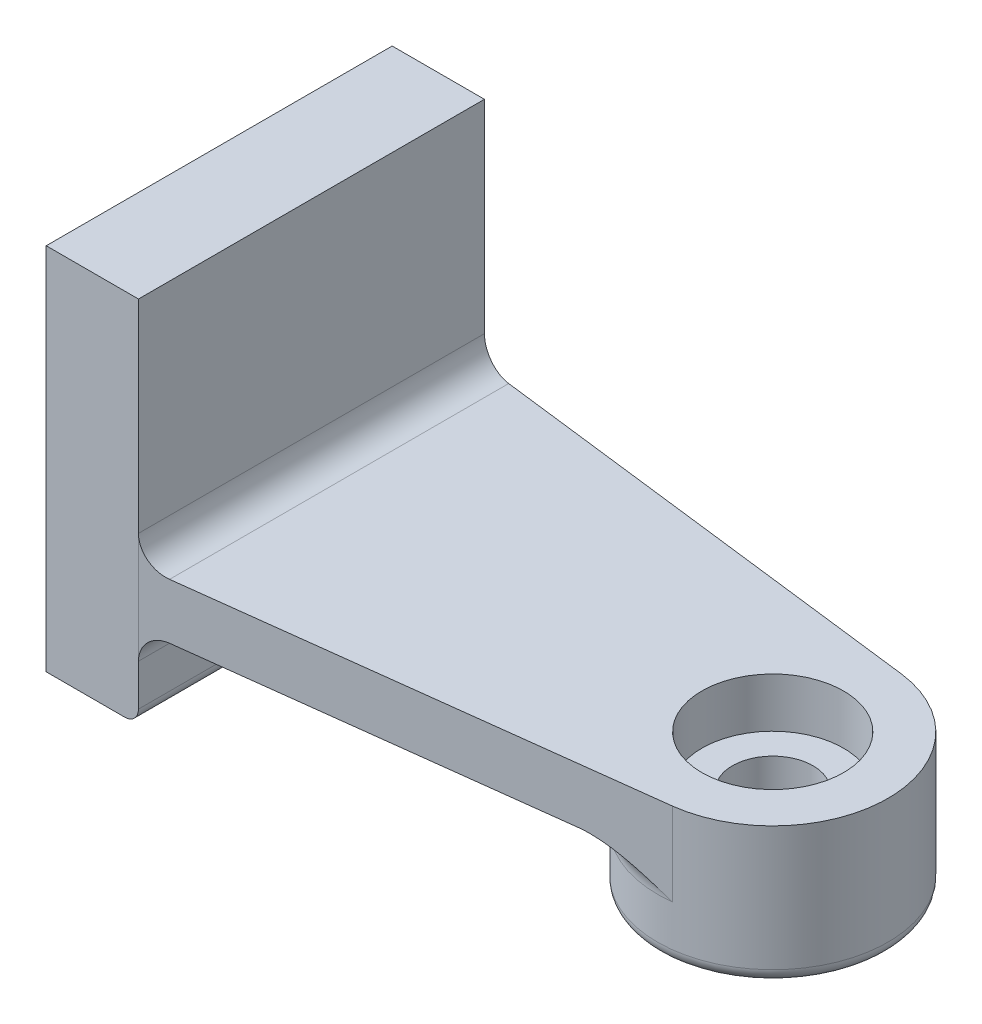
ISO-10303-21;
HEADER;
FILE_DESCRIPTION(('STEP AP214'),'2;1');
FILE_NAME('part.step','',(''),(''),'','','');
FILE_SCHEMA(('AUTOMOTIVE_DESIGN { 1 0 10303 214 1 1 1 1 }'));
ENDSEC;
DATA;
#1=APPLICATION_CONTEXT('core data for automotive mechanical design processes');
#2=APPLICATION_PROTOCOL_DEFINITION('international standard','automotive_design',2000,#1);
#3=PRODUCT_CONTEXT('',#1,'mechanical');
#4=PRODUCT('Part','Part','',(#3));
#5=PRODUCT_RELATED_PRODUCT_CATEGORY('part','',(#4));
#6=PRODUCT_DEFINITION_FORMATION('','',#4);
#7=PRODUCT_DEFINITION_CONTEXT('part definition',#1,'design');
#8=PRODUCT_DEFINITION('design','',#6,#7);
#9=PRODUCT_DEFINITION_SHAPE('','',#8);
#10=(LENGTH_UNIT() NAMED_UNIT(*) SI_UNIT(.MILLI.,.METRE.));
#11=(NAMED_UNIT(*) PLANE_ANGLE_UNIT() SI_UNIT($,.RADIAN.));
#12=(NAMED_UNIT(*) SI_UNIT($,.STERADIAN.) SOLID_ANGLE_UNIT());
#13=UNCERTAINTY_MEASURE_WITH_UNIT(LENGTH_MEASURE(1.E-05),#10,'distance_accuracy_value','');
#14=(GEOMETRIC_REPRESENTATION_CONTEXT(3) GLOBAL_UNCERTAINTY_ASSIGNED_CONTEXT((#13)) GLOBAL_UNIT_ASSIGNED_CONTEXT((#10,
#11,#12)) REPRESENTATION_CONTEXT('',''));
#15=CARTESIAN_POINT('',(0.,0.,0.));
#16=DIRECTION('',(0.,0.,1.));
#17=DIRECTION('',(1.,0.,0.));
#18=AXIS2_PLACEMENT_3D('',#15,#16,#17);
#19=CARTESIAN_POINT('',(100.,0.,0.));
#20=DIRECTION('',(0.,-1.,0.));
#21=DIRECTION('',(0.,0.,-1.));
#22=AXIS2_PLACEMENT_3D('',#19,#20,#21);
#23=PLANE('',#22);
#24=DIRECTION('',(-0.992506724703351,0.,-0.122190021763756));
#25=VECTOR('',#24,1.);
#26=CARTESIAN_POINT('',(0.,0.,-37.5));
#27=LINE('',#26,#25);
#28=CARTESIAN_POINT('',(84.8618017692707,0.,-27.0524482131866));
#29=VERTEX_POINT('',#28);
#30=CARTESIAN_POINT('',(6.,0.,-36.7613247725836));
#31=VERTEX_POINT('',#30);
#32=EDGE_CURVE('E242',#29,#31,#27,.T.);
#33=ORIENTED_EDGE('',*,*,#32,.F.);
#34=CARTESIAN_POINT('',(100.,0.,0.));
#35=DIRECTION('',(0.,-1.,0.));
#36=DIRECTION('',(0.,0.,-1.));
#37=AXIS2_PLACEMENT_3D('',#34,#35,#36);
#38=CIRCLE('',#37,31.);
#39=CARTESIAN_POINT('',(71.4167881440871,0.,-12.));
#40=VERTEX_POINT('',#39);
#41=EDGE_CURVE('E383',#29,#40,#38,.F.);
#42=ORIENTED_EDGE('',*,*,#41,.T.);
#43=DIRECTION('',(-1.,0.,0.));
#44=VECTOR('',#43,1.);
#45=CARTESIAN_POINT('',(100.,0.,-12.));
#46=LINE('',#45,#44);
#47=CARTESIAN_POINT('',(6.00000000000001,0.,-12.));
#48=VERTEX_POINT('',#47);
#49=EDGE_CURVE('E294',#40,#48,#46,.T.);
#50=ORIENTED_EDGE('',*,*,#49,.T.);
#51=DIRECTION('',(0.,0.,1.));
#52=VECTOR('',#51,1.);
#53=CARTESIAN_POINT('',(6.00000000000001,0.,0.));
#54=LINE('',#53,#52);
#55=EDGE_CURVE('E316',#48,#31,#54,.F.);
#56=ORIENTED_EDGE('',*,*,#55,.T.);
#57=EDGE_LOOP('',(#33,#42,#50,#56));
#58=FACE_BOUND('',#57,.T.);
#59=ADVANCED_FACE('F36',(#58),#23,.T.);
#60=CARTESIAN_POINT('',(0.,-18.,-37.5));
#61=DIRECTION('',(-1.,0.,0.));
#62=DIRECTION('',(0.,0.,1.));
#63=AXIS2_PLACEMENT_3D('',#60,#61,#62);
#64=PLANE('',#63);
#65=DIRECTION('',(0.,1.,0.));
#66=VECTOR('',#65,1.);
#67=CARTESIAN_POINT('',(0.,-18.,-12.));
#68=LINE('',#67,#66);
#69=CARTESIAN_POINT('',(0.,-6.,-12.));
#70=VERTEX_POINT('',#69);
#71=CARTESIAN_POINT('',(0.,-15.,-12.));
#72=VERTEX_POINT('',#71);
#73=EDGE_CURVE('E398',#70,#72,#68,.F.);
#74=ORIENTED_EDGE('',*,*,#73,.T.);
#75=DIRECTION('',(0.,0.,1.));
#76=VECTOR('',#75,1.);
#77=CARTESIAN_POINT('',(0.,-15.,-37.5));
#78=LINE('',#77,#76);
#79=CARTESIAN_POINT('',(0.,-15.,-37.5));
#80=VERTEX_POINT('',#79);
#81=EDGE_CURVE('E862',#72,#80,#78,.F.);
#82=ORIENTED_EDGE('',*,*,#81,.T.);
#83=DIRECTION('',(0.,-1.,0.));
#84=VECTOR('',#83,1.);
#85=CARTESIAN_POINT('',(0.,62.,-37.5));
#86=LINE('',#85,#84);
#87=CARTESIAN_POINT('',(0.,-6.00000000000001,-37.5));
#88=VERTEX_POINT('',#87);
#89=EDGE_CURVE('E253',#88,#80,#86,.T.);
#90=ORIENTED_EDGE('',*,*,#89,.F.);
#91=DIRECTION('',(0.,0.,1.));
#92=VECTOR('',#91,1.);
#93=CARTESIAN_POINT('',(0.,-6.,-37.5));
#94=LINE('',#93,#92);
#95=EDGE_CURVE('E269',#88,#70,#94,.T.);
#96=ORIENTED_EDGE('',*,*,#95,.T.);
#97=EDGE_LOOP('',(#74,#82,#90,#96));
#98=FACE_BOUND('',#97,.T.);
#99=ADVANCED_FACE('F471',(#98),#64,.F.);
#100=DIRECTION('',(0.,0.,1.));
#101=VECTOR('',#100,1.);
#102=CARTESIAN_POINT('',(6.00000000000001,0.,0.));
#103=LINE('',#102,#101);
#104=CARTESIAN_POINT('',(6.,0.,36.7613247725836));
#105=VERTEX_POINT('',#104);
#106=CARTESIAN_POINT('',(6.00000000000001,0.,12.));
#107=VERTEX_POINT('',#106);
#108=EDGE_CURVE('E310',#105,#107,#103,.F.);
#109=ORIENTED_EDGE('',*,*,#108,.T.);
#110=DIRECTION('',(-1.,0.,0.));
#111=VECTOR('',#110,1.);
#112=CARTESIAN_POINT('',(71.4167881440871,0.,12.));
#113=LINE('',#112,#111);
#114=CARTESIAN_POINT('',(71.4167881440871,0.,12.));
#115=VERTEX_POINT('',#114);
#116=EDGE_CURVE('E292',#107,#115,#113,.F.);
#117=ORIENTED_EDGE('',*,*,#116,.T.);
#118=CARTESIAN_POINT('',(100.,0.,0.));
#119=DIRECTION('',(0.,-1.,0.));
#120=DIRECTION('',(0.,0.,-1.));
#121=AXIS2_PLACEMENT_3D('',#118,#119,#120);
#122=CIRCLE('',#121,31.);
#123=CARTESIAN_POINT('',(84.8618017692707,0.,27.0524482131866));
#124=VERTEX_POINT('',#123);
#125=EDGE_CURVE('E290',#115,#124,#122,.F.);
#126=ORIENTED_EDGE('',*,*,#125,.T.);
#127=DIRECTION('',(0.992506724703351,0.,-0.122190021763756));
#128=VECTOR('',#127,1.);
#129=CARTESIAN_POINT('',(0.,0.,37.5));
#130=LINE('',#129,#128);
#131=EDGE_CURVE('E239',#105,#124,#130,.T.);
#132=ORIENTED_EDGE('',*,*,#131,.F.);
#133=EDGE_LOOP('',(#109,#117,#126,#132));
#134=FACE_BOUND('',#133,.T.);
#135=ADVANCED_FACE('F424',(#134),#23,.T.);
#136=CARTESIAN_POINT('',(0.,12.,37.5));
#137=DIRECTION('',(-0.122190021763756,0.,-0.992506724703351));
#138=DIRECTION('',(-0.992506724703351,0.,0.122190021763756));
#139=AXIS2_PLACEMENT_3D('',#136,#137,#138);
#140=PLANE('',#139);
#141=DIRECTION('',(0.,-1.,0.));
#142=VECTOR('',#141,1.);
#143=CARTESIAN_POINT('',(0.,12.,37.5));
#144=LINE('',#143,#142);
#145=CARTESIAN_POINT('',(0.,18.,37.5));
#146=VERTEX_POINT('',#145);
#147=CARTESIAN_POINT('',(0.,-6.,37.5));
#148=VERTEX_POINT('',#147);
#149=EDGE_CURVE('E339',#146,#148,#144,.T.);
#150=ORIENTED_EDGE('',*,*,#149,.T.);
#151=CARTESIAN_POINT('',(6.,-6.,36.7613247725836));
#152=DIRECTION('',(-0.122190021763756,0.,-0.992506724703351));
#153=DIRECTION('',(-0.992506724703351,0.,0.122190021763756));
#154=AXIS2_PLACEMENT_3D('',#151,#152,#153);
#155=ELLIPSE('',#154,6.04529909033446,6.);
#156=EDGE_CURVE('E277',#148,#105,#155,.T.);
#157=ORIENTED_EDGE('',*,*,#156,.T.);
#158=ORIENTED_EDGE('',*,*,#131,.T.);
#159=CARTESIAN_POINT('',(84.8618017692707,0.,27.0524482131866));
#160=CARTESIAN_POINT('',(85.1862334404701,-3.27743544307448E-05,27.0125066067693));
#161=CARTESIAN_POINT('',(85.5105668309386,-0.00933756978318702,26.9725770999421));
#162=CARTESIAN_POINT('',(86.1581547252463,-0.04477372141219,26.8928509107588));
#163=CARTESIAN_POINT('',(86.4814097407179,-0.0708954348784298,26.8530541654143));
#164=CARTESIAN_POINT('',(87.1253884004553,-0.138153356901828,26.7737723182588));
#165=CARTESIAN_POINT('',(87.4461166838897,-0.179245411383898,26.734286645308));
#166=CARTESIAN_POINT('',(88.0855999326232,-0.274982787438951,26.6555582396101));
#167=CARTESIAN_POINT('',(88.4043545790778,-0.329630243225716,26.6163155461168));
#168=CARTESIAN_POINT('',(89.3490391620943,-0.51029693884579,26.5000130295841));
#169=CARTESIAN_POINT('',(89.9716743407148,-0.65397965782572,26.4233588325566));
#170=CARTESIAN_POINT('',(91.2072563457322,-0.979869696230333,26.271243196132));
#171=CARTESIAN_POINT('',(91.8201943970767,-1.16210997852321,26.1957828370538));
#172=CARTESIAN_POINT('',(92.8856905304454,-1.50856862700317,26.0646069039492));
#173=CARTESIAN_POINT('',(93.3404203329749,-1.66609616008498,26.0086239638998));
#174=CARTESIAN_POINT('',(94.2446138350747,-1.99585169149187,25.8973064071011));
#175=CARTESIAN_POINT('',(94.694077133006,-2.16808080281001,25.8419718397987));
#176=CARTESIAN_POINT('',(96.0352444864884,-2.70291236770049,25.6768573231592));
#177=CARTESIAN_POINT('',(96.9197922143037,-3.08368139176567,25.5679584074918));
#178=CARTESIAN_POINT('',(98.6783128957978,-3.87713108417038,25.3514624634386));
#179=CARTESIAN_POINT('',(99.5522342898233,-4.28992516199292,25.2438717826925));
#180=CARTESIAN_POINT('',(101.292974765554,-5.1304855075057,25.0295648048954));
#181=CARTESIAN_POINT('',(102.15979321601,-5.55825308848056,24.922848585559));
#182=CARTESIAN_POINT('',(103.035960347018,-5.99072522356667,24.8149814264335));
#183=CARTESIAN_POINT('',(103.045355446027,-5.9953626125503,24.8138247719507));
#184=CARTESIAN_POINT('',(103.054750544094,-6.,24.8126681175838));
#185=B_SPLINE_CURVE_WITH_KNOTS('',3,(#159,#160,#161,#162,#163,#164,#165,#166,#167,#168,#169,
#170,#171,#172,#173,#174,#175,#176,#177,#178,#179,#180,#181,#182,#183,#184),.UNSPECIFIED.,.F.,
.F.,(4,2,2,2,2,2,2,2,2,2,2,2,4),(0.,0.98036870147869,1.96017576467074,2.93711604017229,
3.91421022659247,5.84327000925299,7.77398565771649,9.227172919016,10.6804702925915,
13.5868543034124,16.5040468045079,19.4214958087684,19.4531185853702),.UNSPECIFIED.);
#186=CARTESIAN_POINT('',(103.054750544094,-6.,24.8126681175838));
#187=VERTEX_POINT('',#186);
#188=EDGE_CURVE('E370',#124,#187,#185,.T.);
#189=ORIENTED_EDGE('',*,*,#188,.T.);
#190=DIRECTION('',(0.,-1.,0.));
#191=VECTOR('',#190,1.);
#192=CARTESIAN_POINT('',(103.054750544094,12.,24.8126681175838));
#193=LINE('',#192,#191);
#194=CARTESIAN_POINT('',(103.054750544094,12.,24.8126681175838));
#195=VERTEX_POINT('',#194);
#196=EDGE_CURVE('E344',#195,#187,#193,.T.);
#197=ORIENTED_EDGE('',*,*,#196,.F.);
#198=DIRECTION('',(0.992506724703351,0.,-0.122190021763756));
#199=VECTOR('',#198,1.);
#200=CARTESIAN_POINT('',(0.,12.,37.5));
#201=LINE('',#200,#199);
#202=CARTESIAN_POINT('',(6.00000000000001,12.,36.7613247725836));
#203=VERTEX_POINT('',#202);
#204=EDGE_CURVE('E297',#203,#195,#201,.T.);
#205=ORIENTED_EDGE('',*,*,#204,.F.);
#206=CARTESIAN_POINT('',(6.00000000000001,18.,36.7613247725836));
#207=DIRECTION('',(-0.122190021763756,0.,-0.992506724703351));
#208=DIRECTION('',(0.992506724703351,0.,-0.122190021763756));
#209=AXIS2_PLACEMENT_3D('',#206,#207,#208);
#210=ELLIPSE('',#209,6.04529909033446,6.);
#211=EDGE_CURVE('E272',#203,#146,#210,.T.);
#212=ORIENTED_EDGE('',*,*,#211,.T.);
#213=EDGE_LOOP('',(#150,#157,#158,#189,#197,#205,#212));
#214=FACE_BOUND('',#213,.T.);
#215=ADVANCED_FACE('F371',(#214),#140,.F.);
#216=CARTESIAN_POINT('',(100.,12.,0.));
#217=DIRECTION('',(0.,-1.,0.));
#218=DIRECTION('',(0.,0.,-1.));
#219=AXIS2_PLACEMENT_3D('',#216,#217,#218);
#220=CYLINDRICAL_SURFACE('',#219,25.);
#221=DIRECTION('',(0.,-1.,0.));
#222=VECTOR('',#221,1.);
#223=CARTESIAN_POINT('',(76.9490226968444,12.,9.67741935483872));
#224=LINE('',#223,#222);
#225=CARTESIAN_POINT('',(76.9490226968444,-6.,9.67741935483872));
#226=VERTEX_POINT('',#225);
#227=CARTESIAN_POINT('',(76.9490226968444,-15.,9.67741935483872));
#228=VERTEX_POINT('',#227);
#229=EDGE_CURVE('E326',#226,#228,#224,.T.);
#230=ORIENTED_EDGE('',*,*,#229,.T.);
#231=CARTESIAN_POINT('',(100.,-15.,0.));
#232=DIRECTION('',(0.,1.,0.));
#233=DIRECTION('',(0.,0.,1.));
#234=AXIS2_PLACEMENT_3D('',#231,#232,#233);
#235=CIRCLE('',#234,25.);
#236=CARTESIAN_POINT('',(76.9490226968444,-15.,-9.67741935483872));
#237=VERTEX_POINT('',#236);
#238=EDGE_CURVE('E60',#228,#237,#235,.T.);
#239=ORIENTED_EDGE('',*,*,#238,.T.);
#240=DIRECTION('',(0.,-1.,0.));
#241=VECTOR('',#240,1.);
#242=CARTESIAN_POINT('',(76.9490226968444,12.,-9.67741935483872));
#243=LINE('',#242,#241);
#244=CARTESIAN_POINT('',(76.9490226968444,-6.,-9.67741935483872));
#245=VERTEX_POINT('',#244);
#246=EDGE_CURVE('E321',#237,#245,#243,.F.);
#247=ORIENTED_EDGE('',*,*,#246,.T.);
#248=CARTESIAN_POINT('',(100.,-6.,0.));
#249=DIRECTION('',(0.,-1.,0.));
#250=DIRECTION('',(0.,0.,-1.));
#251=AXIS2_PLACEMENT_3D('',#248,#249,#250);
#252=CIRCLE('',#251,25.);
#253=CARTESIAN_POINT('',(103.054750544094,-6.,-24.8126681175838));
#254=VERTEX_POINT('',#253);
#255=EDGE_CURVE('E382',#245,#254,#252,.T.);
#256=ORIENTED_EDGE('',*,*,#255,.T.);
#257=DIRECTION('',(0.,-1.,0.));
#258=VECTOR('',#257,1.);
#259=CARTESIAN_POINT('',(103.054750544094,12.,-24.8126681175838));
#260=LINE('',#259,#258);
#261=CARTESIAN_POINT('',(103.054750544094,12.,-24.8126681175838));
#262=VERTEX_POINT('',#261);
#263=EDGE_CURVE('E354',#262,#254,#260,.T.);
#264=ORIENTED_EDGE('',*,*,#263,.F.);
#265=CARTESIAN_POINT('',(100.,12.,0.));
#266=DIRECTION('',(0.,1.,0.));
#267=DIRECTION('',(0.,0.,-1.));
#268=AXIS2_PLACEMENT_3D('',#265,#266,#267);
#269=CIRCLE('',#268,25.);
#270=EDGE_CURVE('E254',#195,#262,#269,.T.);
#271=ORIENTED_EDGE('',*,*,#270,.F.);
#272=ORIENTED_EDGE('',*,*,#196,.T.);
#273=CARTESIAN_POINT('',(100.,-6.,0.));
#274=DIRECTION('',(0.,-1.,0.));
#275=DIRECTION('',(0.,0.,-1.));
#276=AXIS2_PLACEMENT_3D('',#273,#274,#275);
#277=CIRCLE('',#276,25.);
#278=EDGE_CURVE('E365',#187,#226,#277,.T.);
#279=ORIENTED_EDGE('',*,*,#278,.T.);
#280=EDGE_LOOP('',(#230,#239,#247,#256,#264,#271,#272,#279));
#281=FACE_BOUND('',#280,.T.);
#282=ADVANCED_FACE('F363',(#281),#220,.T.);
#283=CARTESIAN_POINT('',(0.,12.,-37.5));
#284=DIRECTION('',(-0.122190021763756,0.,0.992506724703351));
#285=DIRECTION('',(0.992506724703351,0.,0.122190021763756));
#286=AXIS2_PLACEMENT_3D('',#283,#284,#285);
#287=PLANE('',#286);
#288=ORIENTED_EDGE('',*,*,#263,.T.);
#289=CARTESIAN_POINT('',(84.8618017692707,0.,-27.0524482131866));
#290=CARTESIAN_POINT('',(85.1862334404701,-3.27743544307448E-05,-27.0125066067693));
#291=CARTESIAN_POINT('',(85.5105668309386,-0.00933756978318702,-26.9725770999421));
#292=CARTESIAN_POINT('',(86.1581547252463,-0.04477372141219,-26.8928509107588));
#293=CARTESIAN_POINT('',(86.4814097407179,-0.0708954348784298,-26.8530541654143));
#294=CARTESIAN_POINT('',(87.1253884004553,-0.138153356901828,-26.7737723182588));
#295=CARTESIAN_POINT('',(87.4461166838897,-0.179245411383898,-26.734286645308));
#296=CARTESIAN_POINT('',(88.0855999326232,-0.274982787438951,-26.6555582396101));
#297=CARTESIAN_POINT('',(88.4043545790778,-0.329630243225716,-26.6163155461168));
#298=CARTESIAN_POINT('',(89.3490391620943,-0.51029693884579,-26.5000130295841));
#299=CARTESIAN_POINT('',(89.9716743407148,-0.65397965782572,-26.4233588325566));
#300=CARTESIAN_POINT('',(91.2072563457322,-0.979869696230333,-26.271243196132));
#301=CARTESIAN_POINT('',(91.8201943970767,-1.16210997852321,-26.1957828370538));
#302=CARTESIAN_POINT('',(92.8856905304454,-1.50856862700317,-26.0646069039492));
#303=CARTESIAN_POINT('',(93.3404203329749,-1.66609616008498,-26.0086239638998));
#304=CARTESIAN_POINT('',(94.2446138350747,-1.99585169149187,-25.8973064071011));
#305=CARTESIAN_POINT('',(94.694077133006,-2.16808080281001,-25.8419718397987));
#306=CARTESIAN_POINT('',(96.0352444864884,-2.70291236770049,-25.6768573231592));
#307=CARTESIAN_POINT('',(96.9197922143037,-3.08368139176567,-25.5679584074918));
#308=CARTESIAN_POINT('',(98.6783128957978,-3.87713108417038,-25.3514624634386));
#309=CARTESIAN_POINT('',(99.5522342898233,-4.28992516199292,-25.2438717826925));
#310=CARTESIAN_POINT('',(101.292974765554,-5.1304855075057,-25.0295648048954));
#311=CARTESIAN_POINT('',(102.15979321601,-5.55825308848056,-24.922848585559));
#312=CARTESIAN_POINT('',(103.035960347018,-5.99072522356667,-24.8149814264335));
#313=CARTESIAN_POINT('',(103.045355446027,-5.9953626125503,-24.8138247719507));
#314=CARTESIAN_POINT('',(103.054750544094,-6.,-24.8126681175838));
#315=B_SPLINE_CURVE_WITH_KNOTS('',3,(#289,#290,#291,#292,#293,#294,#295,#296,#297,#298,#299,
#300,#301,#302,#303,#304,#305,#306,#307,#308,#309,#310,#311,#312,#313,#314),.UNSPECIFIED.,.F.,
.F.,(4,2,2,2,2,2,2,2,2,2,2,2,4),(0.,0.98036870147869,1.96017576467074,2.93711604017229,
3.91421022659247,5.84327000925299,7.77398565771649,9.227172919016,10.6804702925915,
13.5868543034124,16.5040468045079,19.4214958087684,19.4531185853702),.UNSPECIFIED.);
#316=EDGE_CURVE('E375',#254,#29,#315,.F.);
#317=ORIENTED_EDGE('',*,*,#316,.T.);
#318=ORIENTED_EDGE('',*,*,#32,.T.);
#319=CARTESIAN_POINT('',(6.,-6.,-36.7613247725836));
#320=DIRECTION('',(-0.122190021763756,0.,0.992506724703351));
#321=DIRECTION('',(0.992506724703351,0.,0.122190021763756));
#322=AXIS2_PLACEMENT_3D('',#319,#320,#321);
#323=ELLIPSE('',#322,6.04529909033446,6.);
#324=EDGE_CURVE('E279',#31,#88,#323,.T.);
#325=ORIENTED_EDGE('',*,*,#324,.T.);
#326=DIRECTION('',(0.,-1.,0.));
#327=VECTOR('',#326,1.);
#328=CARTESIAN_POINT('',(0.,12.,-37.5));
#329=LINE('',#328,#327);
#330=CARTESIAN_POINT('',(0.,18.,-37.5));
#331=VERTEX_POINT('',#330);
#332=EDGE_CURVE('E352',#331,#88,#329,.T.);
#333=ORIENTED_EDGE('',*,*,#332,.F.);
#334=CARTESIAN_POINT('',(6.00000000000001,18.,-36.7613247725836));
#335=DIRECTION('',(-0.122190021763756,0.,0.992506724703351));
#336=DIRECTION('',(-0.992506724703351,0.,-0.122190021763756));
#337=AXIS2_PLACEMENT_3D('',#334,#335,#336);
#338=ELLIPSE('',#337,6.04529909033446,6.);
#339=CARTESIAN_POINT('',(6.00000000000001,12.,-36.7613247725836));
#340=VERTEX_POINT('',#339);
#341=EDGE_CURVE('E275',#331,#340,#338,.T.);
#342=ORIENTED_EDGE('',*,*,#341,.T.);
#343=DIRECTION('',(-0.992506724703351,0.,-0.122190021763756));
#344=VECTOR('',#343,1.);
#345=CARTESIAN_POINT('',(0.,12.,-37.5));
#346=LINE('',#345,#344);
#347=EDGE_CURVE('E349',#262,#340,#346,.T.);
#348=ORIENTED_EDGE('',*,*,#347,.F.);
#349=EDGE_LOOP('',(#288,#317,#318,#325,#333,#342,#348));
#350=FACE_BOUND('',#349,.T.);
#351=ADVANCED_FACE('F418',(#350),#287,.F.);
#352=CARTESIAN_POINT('',(100.,12.,0.));
#353=DIRECTION('',(0.,-1.,0.));
#354=DIRECTION('',(0.,0.,-1.));
#355=AXIS2_PLACEMENT_3D('',#352,#353,#354);
#356=PLANE('',#355);
#357=CARTESIAN_POINT('',(100.,12.,0.));
#358=DIRECTION('',(0.,1.,0.));
#359=DIRECTION('',(0.,0.,1.));
#360=AXIS2_PLACEMENT_3D('',#357,#358,#359);
#361=CIRCLE('',#360,15.355);
#362=CARTESIAN_POINT('',(100.,12.,15.355));
#363=VERTEX_POINT('',#362);
#364=EDGE_CURVE('E956',#363,#363,#361,.T.);
#365=ORIENTED_EDGE('',*,*,#364,.F.);
#366=EDGE_LOOP('',(#365));
#367=FACE_BOUND('',#366,.T.);
#368=ORIENTED_EDGE('',*,*,#347,.T.);
#369=DIRECTION('',(0.,0.,1.));
#370=VECTOR('',#369,1.);
#371=CARTESIAN_POINT('',(6.00000000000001,12.,37.5));
#372=LINE('',#371,#370);
#373=EDGE_CURVE('E335',#340,#203,#372,.T.);
#374=ORIENTED_EDGE('',*,*,#373,.T.);
#375=ORIENTED_EDGE('',*,*,#204,.T.);
#376=ORIENTED_EDGE('',*,*,#270,.T.);
#377=EDGE_LOOP('',(#368,#374,#375,#376));
#378=FACE_BOUND('',#377,.T.);
#379=ADVANCED_FACE('F423',(#367,#378),#356,.F.);
#380=DIRECTION('',(0.,1.,0.));
#381=VECTOR('',#380,1.);
#382=CARTESIAN_POINT('',(0.,62.,37.5));
#383=LINE('',#382,#381);
#384=CARTESIAN_POINT('',(0.,-15.,37.5));
#385=VERTEX_POINT('',#384);
#386=EDGE_CURVE('E337',#385,#148,#383,.T.);
#387=ORIENTED_EDGE('',*,*,#386,.F.);
#388=DIRECTION('',(0.,0.,1.));
#389=VECTOR('',#388,1.);
#390=CARTESIAN_POINT('',(0.,-15.,-37.5));
#391=LINE('',#390,#389);
#392=CARTESIAN_POINT('',(0.,-15.,12.));
#393=VERTEX_POINT('',#392);
#394=EDGE_CURVE('E860',#385,#393,#391,.F.);
#395=ORIENTED_EDGE('',*,*,#394,.T.);
#396=DIRECTION('',(0.,1.,0.));
#397=VECTOR('',#396,1.);
#398=CARTESIAN_POINT('',(0.,-18.,12.));
#399=LINE('',#398,#397);
#400=CARTESIAN_POINT('',(0.,-6.,12.));
#401=VERTEX_POINT('',#400);
#402=EDGE_CURVE('E390',#393,#401,#399,.T.);
#403=ORIENTED_EDGE('',*,*,#402,.T.);
#404=DIRECTION('',(0.,0.,1.));
#405=VECTOR('',#404,1.);
#406=CARTESIAN_POINT('',(0.,-6.,-37.5));
#407=LINE('',#406,#405);
#408=EDGE_CURVE('E267',#401,#148,#407,.T.);
#409=ORIENTED_EDGE('',*,*,#408,.T.);
#410=EDGE_LOOP('',(#387,#395,#403,#409));
#411=FACE_BOUND('',#410,.T.);
#412=ADVANCED_FACE('F477',(#411),#64,.F.);
#413=CARTESIAN_POINT('',(-20.,62.,-37.5));
#414=DIRECTION('',(0.,0.,1.));
#415=DIRECTION('',(0.,-1.,0.));
#416=AXIS2_PLACEMENT_3D('',#413,#414,#415);
#417=PLANE('',#416);
#418=ORIENTED_EDGE('',*,*,#89,.T.);
#419=CARTESIAN_POINT('',(-3.,-15.,-37.5));
#420=DIRECTION('',(0.,0.,1.));
#421=DIRECTION('',(0.,-1.,0.));
#422=AXIS2_PLACEMENT_3D('',#419,#420,#421);
#423=CIRCLE('',#422,3.);
#424=CARTESIAN_POINT('',(-3.,-18.,-37.5));
#425=VERTEX_POINT('',#424);
#426=EDGE_CURVE('E238',#80,#425,#423,.F.);
#427=ORIENTED_EDGE('',*,*,#426,.T.);
#428=DIRECTION('',(1.,0.,0.));
#429=VECTOR('',#428,1.);
#430=CARTESIAN_POINT('',(-20.,-18.,-37.5));
#431=LINE('',#430,#429);
#432=CARTESIAN_POINT('',(-20.,-18.,-37.5));
#433=VERTEX_POINT('',#432);
#434=EDGE_CURVE('E217',#433,#425,#431,.T.);
#435=ORIENTED_EDGE('',*,*,#434,.F.);
#436=DIRECTION('',(0.,-1.,0.));
#437=VECTOR('',#436,1.);
#438=CARTESIAN_POINT('',(-20.,62.,-37.5));
#439=LINE('',#438,#437);
#440=CARTESIAN_POINT('',(-20.,62.,-37.5));
#441=VERTEX_POINT('',#440);
#442=EDGE_CURVE('E224',#441,#433,#439,.T.);
#443=ORIENTED_EDGE('',*,*,#442,.F.);
#444=DIRECTION('',(1.,0.,0.));
#445=VECTOR('',#444,1.);
#446=CARTESIAN_POINT('',(-20.,62.,-37.5));
#447=LINE('',#446,#445);
#448=CARTESIAN_POINT('',(0.,62.,-37.5));
#449=VERTEX_POINT('',#448);
#450=EDGE_CURVE('E961',#441,#449,#447,.T.);
#451=ORIENTED_EDGE('',*,*,#450,.T.);
#452=EDGE_CURVE('E248',#449,#331,#86,.T.);
#453=ORIENTED_EDGE('',*,*,#452,.T.);
#454=ORIENTED_EDGE('',*,*,#332,.T.);
#455=EDGE_LOOP('',(#418,#427,#435,#443,#451,#453,#454));
#456=FACE_BOUND('',#455,.T.);
#457=ADVANCED_FACE('F236',(#456),#417,.F.);
#458=CARTESIAN_POINT('',(-20.,-18.,-37.5));
#459=DIRECTION('',(0.,1.,0.));
#460=DIRECTION('',(0.,0.,1.));
#461=AXIS2_PLACEMENT_3D('',#458,#459,#460);
#462=PLANE('',#461);
#463=ORIENTED_EDGE('',*,*,#434,.T.);
#464=DIRECTION('',(0.,0.,1.));
#465=VECTOR('',#464,1.);
#466=CARTESIAN_POINT('',(-3.,-18.,-37.5));
#467=LINE('',#466,#465);
#468=CARTESIAN_POINT('',(-3.,-18.,-12.));
#469=VERTEX_POINT('',#468);
#470=EDGE_CURVE('E926',#425,#469,#467,.T.);
#471=ORIENTED_EDGE('',*,*,#470,.T.);
#472=CARTESIAN_POINT('',(6.,-18.,-12.));
#473=DIRECTION('',(0.,1.,0.));
#474=DIRECTION('',(0.,0.,1.));
#475=AXIS2_PLACEMENT_3D('',#472,#473,#474);
#476=CIRCLE('',#475,9.);
#477=CARTESIAN_POINT('',(6.,-18.,-3.));
#478=VERTEX_POINT('',#477);
#479=EDGE_CURVE('E924',#469,#478,#476,.T.);
#480=ORIENTED_EDGE('',*,*,#479,.T.);
#481=DIRECTION('',(1.,0.,0.));
#482=VECTOR('',#481,1.);
#483=CARTESIAN_POINT('',(-20.,-18.,-3.));
#484=LINE('',#483,#482);
#485=CARTESIAN_POINT('',(71.4167881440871,-18.,-3.));
#486=VERTEX_POINT('',#485);
#487=EDGE_CURVE('E374',#478,#486,#484,.T.);
#488=ORIENTED_EDGE('',*,*,#487,.T.);
#489=CARTESIAN_POINT('',(71.4167881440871,-18.,-12.));
#490=DIRECTION('',(0.,1.,0.));
#491=DIRECTION('',(0.,0.,1.));
#492=AXIS2_PLACEMENT_3D('',#489,#490,#491);
#493=CIRCLE('',#492,9.);
#494=CARTESIAN_POINT('',(79.7151399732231,-18.,-8.51612903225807));
#495=VERTEX_POINT('',#494);
#496=EDGE_CURVE('E912',#486,#495,#493,.T.);
#497=ORIENTED_EDGE('',*,*,#496,.T.);
#498=CARTESIAN_POINT('',(100.,-18.,0.));
#499=DIRECTION('',(0.,1.,0.));
#500=DIRECTION('',(0.,0.,1.));
#501=AXIS2_PLACEMENT_3D('',#498,#499,#500);
#502=CIRCLE('',#501,22.);
#503=CARTESIAN_POINT('',(79.7151399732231,-18.,8.51612903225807));
#504=VERTEX_POINT('',#503);
#505=EDGE_CURVE('E914',#495,#504,#502,.F.);
#506=ORIENTED_EDGE('',*,*,#505,.T.);
#507=CARTESIAN_POINT('',(71.4167881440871,-18.,12.));
#508=DIRECTION('',(0.,1.,0.));
#509=DIRECTION('',(0.,0.,1.));
#510=AXIS2_PLACEMENT_3D('',#507,#508,#509);
#511=CIRCLE('',#510,9.);
#512=CARTESIAN_POINT('',(71.4167881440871,-18.,3.));
#513=VERTEX_POINT('',#512);
#514=EDGE_CURVE('E916',#504,#513,#511,.T.);
#515=ORIENTED_EDGE('',*,*,#514,.T.);
#516=DIRECTION('',(1.,0.,0.));
#517=VECTOR('',#516,1.);
#518=CARTESIAN_POINT('',(6.,-18.,3.));
#519=LINE('',#518,#517);
#520=CARTESIAN_POINT('',(6.,-18.,3.));
#521=VERTEX_POINT('',#520);
#522=EDGE_CURVE('E918',#513,#521,#519,.F.);
#523=ORIENTED_EDGE('',*,*,#522,.T.);
#524=CARTESIAN_POINT('',(6.,-18.,12.));
#525=DIRECTION('',(0.,1.,0.));
#526=DIRECTION('',(0.,0.,1.));
#527=AXIS2_PLACEMENT_3D('',#524,#525,#526);
#528=CIRCLE('',#527,9.);
#529=CARTESIAN_POINT('',(-3.,-18.,12.));
#530=VERTEX_POINT('',#529);
#531=EDGE_CURVE('E920',#521,#530,#528,.T.);
#532=ORIENTED_EDGE('',*,*,#531,.T.);
#533=DIRECTION('',(0.,0.,1.));
#534=VECTOR('',#533,1.);
#535=CARTESIAN_POINT('',(-3.,-18.,-37.5));
#536=LINE('',#535,#534);
#537=CARTESIAN_POINT('',(-3.,-18.,37.5));
#538=VERTEX_POINT('',#537);
#539=EDGE_CURVE('E922',#530,#538,#536,.T.);
#540=ORIENTED_EDGE('',*,*,#539,.T.);
#541=DIRECTION('',(1.,0.,0.));
#542=VECTOR('',#541,1.);
#543=CARTESIAN_POINT('',(-20.,-18.,37.5));
#544=LINE('',#543,#542);
#545=CARTESIAN_POINT('',(-20.,-18.,37.5));
#546=VERTEX_POINT('',#545);
#547=EDGE_CURVE('E220',#546,#538,#544,.T.);
#548=ORIENTED_EDGE('',*,*,#547,.F.);
#549=DIRECTION('',(0.,0.,1.));
#550=VECTOR('',#549,1.);
#551=CARTESIAN_POINT('',(-20.,-18.,-37.5));
#552=LINE('',#551,#550);
#553=EDGE_CURVE('E211',#433,#546,#552,.T.);
#554=ORIENTED_EDGE('',*,*,#553,.F.);
#555=EDGE_LOOP('',(#463,#471,#480,#488,#497,#506,#515,#523,#532,#540,#548,#554));
#556=FACE_BOUND('',#555,.T.);
#557=CARTESIAN_POINT('',(100.,-18.,0.));
#558=DIRECTION('',(0.,1.,0.));
#559=DIRECTION('',(0.,0.,1.));
#560=AXIS2_PLACEMENT_3D('',#557,#558,#559);
#561=CIRCLE('',#560,8.75);
#562=CARTESIAN_POINT('',(100.,-18.,8.75));
#563=VERTEX_POINT('',#562);
#564=EDGE_CURVE('E266',#563,#563,#561,.T.);
#565=ORIENTED_EDGE('',*,*,#564,.T.);
#566=EDGE_LOOP('',(#565));
#567=FACE_BOUND('',#566,.T.);
#568=ADVANCED_FACE('F213',(#556,#567),#462,.F.);
#569=CARTESIAN_POINT('',(-20.,62.,37.5));
#570=DIRECTION('',(0.,0.,-1.));
#571=DIRECTION('',(0.,1.,0.));
#572=AXIS2_PLACEMENT_3D('',#569,#570,#571);
#573=PLANE('',#572);
#574=ORIENTED_EDGE('',*,*,#547,.T.);
#575=CARTESIAN_POINT('',(-3.,-15.,37.5));
#576=DIRECTION('',(0.,0.,-1.));
#577=DIRECTION('',(0.,1.,0.));
#578=AXIS2_PLACEMENT_3D('',#575,#576,#577);
#579=CIRCLE('',#578,3.);
#580=EDGE_CURVE('E858',#538,#385,#579,.F.);
#581=ORIENTED_EDGE('',*,*,#580,.T.);
#582=ORIENTED_EDGE('',*,*,#386,.T.);
#583=ORIENTED_EDGE('',*,*,#149,.F.);
#584=CARTESIAN_POINT('',(0.,62.,37.5));
#585=VERTEX_POINT('',#584);
#586=EDGE_CURVE('E252',#146,#585,#383,.T.);
#587=ORIENTED_EDGE('',*,*,#586,.T.);
#588=DIRECTION('',(1.,0.,0.));
#589=VECTOR('',#588,1.);
#590=CARTESIAN_POINT('',(-20.,62.,37.5));
#591=LINE('',#590,#589);
#592=CARTESIAN_POINT('',(-20.,62.,37.5));
#593=VERTEX_POINT('',#592);
#594=EDGE_CURVE('E244',#593,#585,#591,.T.);
#595=ORIENTED_EDGE('',*,*,#594,.F.);
#596=DIRECTION('',(0.,1.,0.));
#597=VECTOR('',#596,1.);
#598=CARTESIAN_POINT('',(-20.,62.,37.5));
#599=LINE('',#598,#597);
#600=EDGE_CURVE('E223',#546,#593,#599,.T.);
#601=ORIENTED_EDGE('',*,*,#600,.F.);
#602=EDGE_LOOP('',(#574,#581,#582,#583,#587,#595,#601));
#603=FACE_BOUND('',#602,.T.);
#604=ADVANCED_FACE('F523',(#603),#573,.F.);
#605=CARTESIAN_POINT('',(-20.,62.,-37.5));
#606=DIRECTION('',(0.,-1.,0.));
#607=DIRECTION('',(0.,0.,-1.));
#608=AXIS2_PLACEMENT_3D('',#605,#606,#607);
#609=PLANE('',#608);
#610=DIRECTION('',(0.,0.,-1.));
#611=VECTOR('',#610,1.);
#612=CARTESIAN_POINT('',(0.,62.,-37.5));
#613=LINE('',#612,#611);
#614=EDGE_CURVE('E233',#585,#449,#613,.T.);
#615=ORIENTED_EDGE('',*,*,#614,.T.);
#616=ORIENTED_EDGE('',*,*,#450,.F.);
#617=DIRECTION('',(0.,0.,-1.));
#618=VECTOR('',#617,1.);
#619=CARTESIAN_POINT('',(-20.,62.,-37.5));
#620=LINE('',#619,#618);
#621=EDGE_CURVE('E229',#593,#441,#620,.T.);
#622=ORIENTED_EDGE('',*,*,#621,.F.);
#623=ORIENTED_EDGE('',*,*,#594,.T.);
#624=EDGE_LOOP('',(#615,#616,#622,#623));
#625=FACE_BOUND('',#624,.T.);
#626=ADVANCED_FACE('F530',(#625),#609,.F.);
#627=CARTESIAN_POINT('',(-20.,-18.,-37.5));
#628=DIRECTION('',(-1.,0.,0.));
#629=DIRECTION('',(0.,0.,1.));
#630=AXIS2_PLACEMENT_3D('',#627,#628,#629);
#631=PLANE('',#630);
#632=ORIENTED_EDGE('',*,*,#621,.T.);
#633=ORIENTED_EDGE('',*,*,#442,.T.);
#634=ORIENTED_EDGE('',*,*,#553,.T.);
#635=ORIENTED_EDGE('',*,*,#600,.T.);
#636=EDGE_LOOP('',(#632,#633,#634,#635));
#637=FACE_BOUND('',#636,.T.);
#638=ADVANCED_FACE('F227',(#637),#631,.T.);
#639=ORIENTED_EDGE('',*,*,#586,.F.);
#640=DIRECTION('',(0.,0.,1.));
#641=VECTOR('',#640,1.);
#642=CARTESIAN_POINT('',(0.,18.,-37.5));
#643=LINE('',#642,#641);
#644=EDGE_CURVE('E332',#146,#331,#643,.F.);
#645=ORIENTED_EDGE('',*,*,#644,.T.);
#646=ORIENTED_EDGE('',*,*,#452,.F.);
#647=ORIENTED_EDGE('',*,*,#614,.F.);
#648=EDGE_LOOP('',(#639,#645,#646,#647));
#649=FACE_BOUND('',#648,.T.);
#650=ADVANCED_FACE('F478',(#649),#64,.F.);
#651=CARTESIAN_POINT('',(52.5,22.,6.));
#652=DIRECTION('',(0.,0.,1.));
#653=DIRECTION('',(1.,0.,0.));
#654=AXIS2_PLACEMENT_3D('',#651,#652,#653);
#655=PLANE('',#654);
#656=DIRECTION('',(0.,1.,0.));
#657=VECTOR('',#656,1.);
#658=CARTESIAN_POINT('',(6.,22.,6.));
#659=LINE('',#658,#657);
#660=CARTESIAN_POINT('',(6.,-6.,6.));
#661=VERTEX_POINT('',#660);
#662=CARTESIAN_POINT('',(6.,-15.,6.));
#663=VERTEX_POINT('',#662);
#664=EDGE_CURVE('E285',#661,#663,#659,.F.);
#665=ORIENTED_EDGE('',*,*,#664,.T.);
#666=DIRECTION('',(1.,0.,0.));
#667=VECTOR('',#666,1.);
#668=CARTESIAN_POINT('',(71.4167881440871,-15.,6.));
#669=LINE('',#668,#667);
#670=CARTESIAN_POINT('',(71.4167881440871,-15.,6.));
#671=VERTEX_POINT('',#670);
#672=EDGE_CURVE('E870',#663,#671,#669,.T.);
#673=ORIENTED_EDGE('',*,*,#672,.T.);
#674=DIRECTION('',(0.,-1.,0.));
#675=VECTOR('',#674,1.);
#676=CARTESIAN_POINT('',(71.4167881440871,22.,6.));
#677=LINE('',#676,#675);
#678=CARTESIAN_POINT('',(71.4167881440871,-6.,6.));
#679=VERTEX_POINT('',#678);
#680=EDGE_CURVE('E308',#671,#679,#677,.F.);
#681=ORIENTED_EDGE('',*,*,#680,.T.);
#682=DIRECTION('',(-1.,0.,0.));
#683=VECTOR('',#682,1.);
#684=CARTESIAN_POINT('',(6.00000000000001,-6.,6.));
#685=LINE('',#684,#683);
#686=EDGE_CURVE('E288',#679,#661,#685,.T.);
#687=ORIENTED_EDGE('',*,*,#686,.T.);
#688=EDGE_LOOP('',(#665,#673,#681,#687));
#689=FACE_BOUND('',#688,.T.);
#690=ADVANCED_FACE('F552',(#689),#655,.T.);
#691=CARTESIAN_POINT('',(52.5,22.,-6.));
#692=DIRECTION('',(0.,0.,1.));
#693=DIRECTION('',(1.,0.,0.));
#694=AXIS2_PLACEMENT_3D('',#691,#692,#693);
#695=PLANE('',#694);
#696=DIRECTION('',(0.,1.,0.));
#697=VECTOR('',#696,1.);
#698=CARTESIAN_POINT('',(71.4167881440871,-18.,-6.));
#699=LINE('',#698,#697);
#700=CARTESIAN_POINT('',(71.4167881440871,-6.,-6.));
#701=VERTEX_POINT('',#700);
#702=CARTESIAN_POINT('',(71.4167881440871,-15.,-6.));
#703=VERTEX_POINT('',#702);
#704=EDGE_CURVE('E330',#701,#703,#699,.F.);
#705=ORIENTED_EDGE('',*,*,#704,.T.);
#706=DIRECTION('',(1.,0.,0.));
#707=VECTOR('',#706,1.);
#708=CARTESIAN_POINT('',(52.5,-15.,-6.));
#709=LINE('',#708,#707);
#710=CARTESIAN_POINT('',(6.,-15.,-6.));
#711=VERTEX_POINT('',#710);
#712=EDGE_CURVE('E11',#703,#711,#709,.F.);
#713=ORIENTED_EDGE('',*,*,#712,.T.);
#714=DIRECTION('',(0.,1.,0.));
#715=VECTOR('',#714,1.);
#716=CARTESIAN_POINT('',(6.,-6.,-6.));
#717=LINE('',#716,#715);
#718=CARTESIAN_POINT('',(6.,-6.,-6.));
#719=VERTEX_POINT('',#718);
#720=EDGE_CURVE('E396',#711,#719,#717,.T.);
#721=ORIENTED_EDGE('',*,*,#720,.T.);
#722=DIRECTION('',(-1.,0.,0.));
#723=VECTOR('',#722,1.);
#724=CARTESIAN_POINT('',(52.5,-6.,-6.));
#725=LINE('',#724,#723);
#726=EDGE_CURVE('E394',#719,#701,#725,.F.);
#727=ORIENTED_EDGE('',*,*,#726,.T.);
#728=EDGE_LOOP('',(#705,#713,#721,#727));
#729=FACE_BOUND('',#728,.T.);
#730=ADVANCED_FACE('F559',(#729),#695,.F.);
#731=CARTESIAN_POINT('',(100.,12.,0.));
#732=DIRECTION('',(0.,1.,0.));
#733=DIRECTION('',(0.,0.,1.));
#734=AXIS2_PLACEMENT_3D('',#731,#732,#733);
#735=CYLINDRICAL_SURFACE('',#734,8.75);
#736=CARTESIAN_POINT('',(100.,1.25,0.));
#737=DIRECTION('',(0.,1.,0.));
#738=DIRECTION('',(0.,0.,1.));
#739=AXIS2_PLACEMENT_3D('',#736,#737,#738);
#740=CIRCLE('',#739,8.75000000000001);
#741=CARTESIAN_POINT('',(100.,1.25,8.75000000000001));
#742=VERTEX_POINT('',#741);
#743=EDGE_CURVE('E950',#742,#742,#740,.T.);
#744=ORIENTED_EDGE('',*,*,#743,.T.);
#745=EDGE_LOOP('',(#744));
#746=FACE_BOUND('',#745,.T.);
#747=ORIENTED_EDGE('',*,*,#564,.F.);
#748=EDGE_LOOP('',(#747));
#749=FACE_BOUND('',#748,.T.);
#750=ADVANCED_FACE('F566',(#746,#749),#735,.F.);
#751=CARTESIAN_POINT('',(100.,12.,0.));
#752=DIRECTION('',(0.,1.,0.));
#753=DIRECTION('',(0.,0.,1.));
#754=AXIS2_PLACEMENT_3D('',#751,#752,#753);
#755=CYLINDRICAL_SURFACE('',#754,15.355);
#756=CARTESIAN_POINT('',(100.,1.25,0.));
#757=DIRECTION('',(0.,1.,0.));
#758=DIRECTION('',(0.,0.,1.));
#759=AXIS2_PLACEMENT_3D('',#756,#757,#758);
#760=CIRCLE('',#759,15.355);
#761=CARTESIAN_POINT('',(100.,1.25,15.355));
#762=VERTEX_POINT('',#761);
#763=EDGE_CURVE('E952',#762,#762,#760,.T.);
#764=ORIENTED_EDGE('',*,*,#763,.F.);
#765=EDGE_LOOP('',(#764));
#766=FACE_BOUND('',#765,.T.);
#767=ORIENTED_EDGE('',*,*,#364,.T.);
#768=EDGE_LOOP('',(#767));
#769=FACE_BOUND('',#768,.T.);
#770=ADVANCED_FACE('F574',(#766,#769),#755,.F.);
#771=CARTESIAN_POINT('',(108.75,1.25,0.));
#772=DIRECTION('',(0.,-1.,0.));
#773=DIRECTION('',(0.,0.,-1.));
#774=AXIS2_PLACEMENT_3D('',#771,#772,#773);
#775=PLANE('',#774);
#776=ORIENTED_EDGE('',*,*,#743,.F.);
#777=EDGE_LOOP('',(#776));
#778=FACE_BOUND('',#777,.T.);
#779=ORIENTED_EDGE('',*,*,#763,.T.);
#780=EDGE_LOOP('',(#779));
#781=FACE_BOUND('',#780,.T.);
#782=ADVANCED_FACE('F434',(#778,#781),#775,.F.);
#783=CARTESIAN_POINT('',(6.00000000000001,18.,0.));
#784=DIRECTION('',(0.,0.,-1.));
#785=DIRECTION('',(-1.,0.,0.));
#786=AXIS2_PLACEMENT_3D('',#783,#784,#785);
#787=CYLINDRICAL_SURFACE('',#786,6.);
#788=ORIENTED_EDGE('',*,*,#341,.F.);
#789=ORIENTED_EDGE('',*,*,#644,.F.);
#790=ORIENTED_EDGE('',*,*,#211,.F.);
#791=ORIENTED_EDGE('',*,*,#373,.F.);
#792=EDGE_LOOP('',(#788,#789,#790,#791));
#793=FACE_BOUND('',#792,.T.);
#794=ADVANCED_FACE('F430',(#793),#787,.F.);
#795=CARTESIAN_POINT('',(71.4167881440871,12.,-12.));
#796=DIRECTION('',(0.,-1.,0.));
#797=DIRECTION('',(0.,0.,-1.));
#798=AXIS2_PLACEMENT_3D('',#795,#796,#797);
#799=CYLINDRICAL_SURFACE('',#798,6.);
#800=ORIENTED_EDGE('',*,*,#246,.F.);
#801=CARTESIAN_POINT('',(71.4167881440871,-15.,-12.));
#802=DIRECTION('',(0.,1.,0.));
#803=DIRECTION('',(0.,0.,1.));
#804=AXIS2_PLACEMENT_3D('',#801,#802,#803);
#805=CIRCLE('',#804,6.);
#806=EDGE_CURVE('E45',#237,#703,#805,.F.);
#807=ORIENTED_EDGE('',*,*,#806,.T.);
#808=ORIENTED_EDGE('',*,*,#704,.F.);
#809=CARTESIAN_POINT('',(71.4167881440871,-6.,-12.));
#810=DIRECTION('',(0.,-1.,0.));
#811=DIRECTION('',(0.,0.,-1.));
#812=AXIS2_PLACEMENT_3D('',#809,#810,#811);
#813=CIRCLE('',#812,6.);
#814=EDGE_CURVE('E401',#701,#245,#813,.F.);
#815=ORIENTED_EDGE('',*,*,#814,.T.);
#816=EDGE_LOOP('',(#800,#807,#808,#815));
#817=FACE_BOUND('',#816,.T.);
#818=ADVANCED_FACE('F433',(#817),#799,.F.);
#819=CARTESIAN_POINT('',(71.4167881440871,12.,12.));
#820=DIRECTION('',(0.,-1.,0.));
#821=DIRECTION('',(0.,0.,-1.));
#822=AXIS2_PLACEMENT_3D('',#819,#820,#821);
#823=CYLINDRICAL_SURFACE('',#822,6.);
#824=ORIENTED_EDGE('',*,*,#680,.F.);
#825=CARTESIAN_POINT('',(71.4167881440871,-15.,12.));
#826=DIRECTION('',(0.,1.,0.));
#827=DIRECTION('',(0.,0.,1.));
#828=AXIS2_PLACEMENT_3D('',#825,#826,#827);
#829=CIRCLE('',#828,6.);
#830=EDGE_CURVE('E872',#671,#228,#829,.F.);
#831=ORIENTED_EDGE('',*,*,#830,.T.);
#832=ORIENTED_EDGE('',*,*,#229,.F.);
#833=CARTESIAN_POINT('',(71.4167881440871,-6.,12.));
#834=DIRECTION('',(0.,-1.,0.));
#835=DIRECTION('',(0.,0.,-1.));
#836=AXIS2_PLACEMENT_3D('',#833,#834,#835);
#837=CIRCLE('',#836,6.);
#838=EDGE_CURVE('E385',#226,#679,#837,.F.);
#839=ORIENTED_EDGE('',*,*,#838,.T.);
#840=EDGE_LOOP('',(#824,#831,#832,#839));
#841=FACE_BOUND('',#840,.T.);
#842=ADVANCED_FACE('F438',(#841),#823,.F.);
#843=CARTESIAN_POINT('',(6.,-6.,-37.5));
#844=DIRECTION('',(0.,0.,1.));
#845=DIRECTION('',(1.,0.,0.));
#846=AXIS2_PLACEMENT_3D('',#843,#844,#845);
#847=CYLINDRICAL_SURFACE('',#846,6.);
#848=ORIENTED_EDGE('',*,*,#408,.F.);
#849=CARTESIAN_POINT('',(6.,-6.,12.));
#850=DIRECTION('',(0.,0.,1.));
#851=DIRECTION('',(1.,0.,0.));
#852=AXIS2_PLACEMENT_3D('',#849,#850,#851);
#853=CIRCLE('',#852,6.);
#854=EDGE_CURVE('E282',#401,#107,#853,.F.);
#855=ORIENTED_EDGE('',*,*,#854,.T.);
#856=ORIENTED_EDGE('',*,*,#108,.F.);
#857=ORIENTED_EDGE('',*,*,#156,.F.);
#858=EDGE_LOOP('',(#848,#855,#856,#857));
#859=FACE_BOUND('',#858,.T.);
#860=ADVANCED_FACE('F441',(#859),#847,.F.);
#861=CARTESIAN_POINT('',(6.,-6.,-37.5));
#862=DIRECTION('',(0.,0.,1.));
#863=DIRECTION('',(1.,0.,0.));
#864=AXIS2_PLACEMENT_3D('',#861,#862,#863);
#865=CYLINDRICAL_SURFACE('',#864,6.);
#866=ORIENTED_EDGE('',*,*,#55,.F.);
#867=CARTESIAN_POINT('',(6.,-6.,-12.));
#868=DIRECTION('',(0.,0.,1.));
#869=DIRECTION('',(1.,0.,0.));
#870=AXIS2_PLACEMENT_3D('',#867,#868,#869);
#871=CIRCLE('',#870,6.);
#872=EDGE_CURVE('E392',#48,#70,#871,.T.);
#873=ORIENTED_EDGE('',*,*,#872,.T.);
#874=ORIENTED_EDGE('',*,*,#95,.F.);
#875=ORIENTED_EDGE('',*,*,#324,.F.);
#876=EDGE_LOOP('',(#866,#873,#874,#875));
#877=FACE_BOUND('',#876,.T.);
#878=ADVANCED_FACE('F445',(#877),#865,.F.);
#879=CARTESIAN_POINT('',(100.,-6.,0.));
#880=DIRECTION('',(0.,-1.,0.));
#881=DIRECTION('',(0.,0.,-1.));
#882=AXIS2_PLACEMENT_3D('',#879,#880,#881);
#883=TOROIDAL_SURFACE('',#882,31.,6.);
#884=CARTESIAN_POINT('',(71.4167881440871,-6.,12.));
#885=DIRECTION('',(0.387096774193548,0.,0.922039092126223));
#886=DIRECTION('',(0.922039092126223,0.,-0.387096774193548));
#887=AXIS2_PLACEMENT_3D('',#884,#885,#886);
#888=CIRCLE('',#887,6.);
#889=EDGE_CURVE('E380',#226,#115,#888,.T.);
#890=ORIENTED_EDGE('',*,*,#889,.F.);
#891=ORIENTED_EDGE('',*,*,#278,.F.);
#892=ORIENTED_EDGE('',*,*,#188,.F.);
#893=ORIENTED_EDGE('',*,*,#125,.F.);
#894=EDGE_LOOP('',(#890,#891,#892,#893));
#895=FACE_BOUND('',#894,.T.);
#896=ADVANCED_FACE('F378',(#895),#883,.F.);
#897=CARTESIAN_POINT('',(71.4167881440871,-6.,12.));
#898=DIRECTION('',(0.,0.,1.));
#899=DIRECTION('',(1.,0.,0.));
#900=AXIS2_PLACEMENT_3D('',#897,#898,#899);
#901=SPHERICAL_SURFACE('',#900,6.);
#902=ORIENTED_EDGE('',*,*,#838,.F.);
#903=ORIENTED_EDGE('',*,*,#889,.T.);
#904=CARTESIAN_POINT('',(71.4167881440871,-6.,12.));
#905=DIRECTION('',(1.,0.,0.));
#906=DIRECTION('',(0.,0.,-1.));
#907=AXIS2_PLACEMENT_3D('',#904,#905,#906);
#908=CIRCLE('',#907,6.);
#909=EDGE_CURVE('E945',#679,#115,#908,.T.);
#910=ORIENTED_EDGE('',*,*,#909,.F.);
#911=EDGE_LOOP('',(#902,#903,#910));
#912=FACE_BOUND('',#911,.T.);
#913=ADVANCED_FACE('F462',(#912),#901,.F.);
#914=CARTESIAN_POINT('',(52.5,-6.,12.));
#915=DIRECTION('',(1.,0.,0.));
#916=DIRECTION('',(0.,0.,-1.));
#917=AXIS2_PLACEMENT_3D('',#914,#915,#916);
#918=CYLINDRICAL_SURFACE('',#917,6.);
#919=ORIENTED_EDGE('',*,*,#909,.T.);
#920=ORIENTED_EDGE('',*,*,#116,.F.);
#921=CARTESIAN_POINT('',(6.,-6.,12.));
#922=DIRECTION('',(1.,0.,0.));
#923=DIRECTION('',(0.,1.,0.));
#924=AXIS2_PLACEMENT_3D('',#921,#922,#923);
#925=CIRCLE('',#924,6.);
#926=EDGE_CURVE('E946',#661,#107,#925,.T.);
#927=ORIENTED_EDGE('',*,*,#926,.F.);
#928=ORIENTED_EDGE('',*,*,#686,.F.);
#929=EDGE_LOOP('',(#919,#920,#927,#928));
#930=FACE_BOUND('',#929,.T.);
#931=ADVANCED_FACE('F458',(#930),#918,.F.);
#932=CARTESIAN_POINT('',(6.,-18.,12.));
#933=DIRECTION('',(0.,1.,0.));
#934=DIRECTION('',(0.,0.,1.));
#935=AXIS2_PLACEMENT_3D('',#932,#933,#934);
#936=CYLINDRICAL_SURFACE('',#935,6.);
#937=ORIENTED_EDGE('',*,*,#402,.F.);
#938=CARTESIAN_POINT('',(6.,-15.,12.));
#939=DIRECTION('',(0.,1.,0.));
#940=DIRECTION('',(0.,0.,1.));
#941=AXIS2_PLACEMENT_3D('',#938,#939,#940);
#942=CIRCLE('',#941,6.);
#943=EDGE_CURVE('E868',#393,#663,#942,.F.);
#944=ORIENTED_EDGE('',*,*,#943,.T.);
#945=ORIENTED_EDGE('',*,*,#664,.F.);
#946=CARTESIAN_POINT('',(6.,-6.,12.));
#947=DIRECTION('',(0.,-1.,0.));
#948=DIRECTION('',(0.,0.,-1.));
#949=AXIS2_PLACEMENT_3D('',#946,#947,#948);
#950=CIRCLE('',#949,6.);
#951=EDGE_CURVE('E910',#401,#661,#950,.T.);
#952=ORIENTED_EDGE('',*,*,#951,.F.);
#953=EDGE_LOOP('',(#937,#944,#945,#952));
#954=FACE_BOUND('',#953,.T.);
#955=ADVANCED_FACE('F454',(#954),#936,.F.);
#956=CARTESIAN_POINT('',(6.,-6.,12.));
#957=DIRECTION('',(0.,0.,1.));
#958=DIRECTION('',(1.,0.,0.));
#959=AXIS2_PLACEMENT_3D('',#956,#957,#958);
#960=SPHERICAL_SURFACE('',#959,6.);
#961=ORIENTED_EDGE('',*,*,#926,.T.);
#962=ORIENTED_EDGE('',*,*,#854,.F.);
#963=ORIENTED_EDGE('',*,*,#951,.T.);
#964=EDGE_LOOP('',(#961,#962,#963));
#965=FACE_BOUND('',#964,.T.);
#966=ADVANCED_FACE('F450',(#965),#960,.F.);
#967=CARTESIAN_POINT('',(6.,22.,-12.));
#968=DIRECTION('',(0.,-1.,0.));
#969=DIRECTION('',(0.,0.,-1.));
#970=AXIS2_PLACEMENT_3D('',#967,#968,#969);
#971=CYLINDRICAL_SURFACE('',#970,6.);
#972=ORIENTED_EDGE('',*,*,#720,.F.);
#973=CARTESIAN_POINT('',(6.,-15.,-12.));
#974=DIRECTION('',(0.,1.,0.));
#975=DIRECTION('',(0.,0.,1.));
#976=AXIS2_PLACEMENT_3D('',#973,#974,#975);
#977=CIRCLE('',#976,6.);
#978=EDGE_CURVE('E844',#711,#72,#977,.F.);
#979=ORIENTED_EDGE('',*,*,#978,.T.);
#980=ORIENTED_EDGE('',*,*,#73,.F.);
#981=CARTESIAN_POINT('',(6.,-6.,-12.));
#982=DIRECTION('',(0.,-1.,0.));
#983=DIRECTION('',(0.,0.,-1.));
#984=AXIS2_PLACEMENT_3D('',#981,#982,#983);
#985=CIRCLE('',#984,6.);
#986=EDGE_CURVE('E846',#719,#70,#985,.T.);
#987=ORIENTED_EDGE('',*,*,#986,.F.);
#988=EDGE_LOOP('',(#972,#979,#980,#987));
#989=FACE_BOUND('',#988,.T.);
#990=ADVANCED_FACE('F453',(#989),#971,.F.);
#991=CARTESIAN_POINT('',(6.,-6.,-12.));
#992=DIRECTION('',(0.,0.,1.));
#993=DIRECTION('',(1.,0.,0.));
#994=AXIS2_PLACEMENT_3D('',#991,#992,#993);
#995=SPHERICAL_SURFACE('',#994,6.);
#996=ORIENTED_EDGE('',*,*,#986,.T.);
#997=ORIENTED_EDGE('',*,*,#872,.F.);
#998=CARTESIAN_POINT('',(6.,-6.,-12.));
#999=DIRECTION('',(-1.,0.,0.));
#1000=DIRECTION('',(0.,-1.,0.));
#1001=AXIS2_PLACEMENT_3D('',#998,#999,#1000);
#1002=CIRCLE('',#1001,6.);
#1003=EDGE_CURVE('E902',#719,#48,#1002,.T.);
#1004=ORIENTED_EDGE('',*,*,#1003,.F.);
#1005=EDGE_LOOP('',(#996,#997,#1004));
#1006=FACE_BOUND('',#1005,.T.);
#1007=ADVANCED_FACE('F639',(#1006),#995,.F.);
#1008=CARTESIAN_POINT('',(100.,-6.,-12.));
#1009=DIRECTION('',(-1.,0.,0.));
#1010=DIRECTION('',(0.,0.,1.));
#1011=AXIS2_PLACEMENT_3D('',#1008,#1009,#1010);
#1012=CYLINDRICAL_SURFACE('',#1011,6.);
#1013=CARTESIAN_POINT('',(71.4167881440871,-6.,-12.));
#1014=DIRECTION('',(-1.,0.,0.));
#1015=DIRECTION('',(0.,0.,1.));
#1016=AXIS2_PLACEMENT_3D('',#1013,#1014,#1015);
#1017=CIRCLE('',#1016,6.);
#1018=EDGE_CURVE('E896',#701,#40,#1017,.T.);
#1019=ORIENTED_EDGE('',*,*,#1018,.F.);
#1020=ORIENTED_EDGE('',*,*,#726,.F.);
#1021=ORIENTED_EDGE('',*,*,#1003,.T.);
#1022=ORIENTED_EDGE('',*,*,#49,.F.);
#1023=EDGE_LOOP('',(#1019,#1020,#1021,#1022));
#1024=FACE_BOUND('',#1023,.T.);
#1025=ADVANCED_FACE('F644',(#1024),#1012,.F.);
#1026=CARTESIAN_POINT('',(71.4167881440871,-6.,-12.));
#1027=DIRECTION('',(0.,0.,1.));
#1028=DIRECTION('',(1.,0.,0.));
#1029=AXIS2_PLACEMENT_3D('',#1026,#1027,#1028);
#1030=SPHERICAL_SURFACE('',#1029,6.);
#1031=ORIENTED_EDGE('',*,*,#814,.F.);
#1032=ORIENTED_EDGE('',*,*,#1018,.T.);
#1033=CARTESIAN_POINT('',(71.4167881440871,-6.,-12.));
#1034=DIRECTION('',(-0.387096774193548,0.,0.922039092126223));
#1035=DIRECTION('',(0.922039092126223,0.,0.387096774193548));
#1036=AXIS2_PLACEMENT_3D('',#1033,#1034,#1035);
#1037=CIRCLE('',#1036,6.);
#1038=EDGE_CURVE('E892',#245,#40,#1037,.T.);
#1039=ORIENTED_EDGE('',*,*,#1038,.F.);
#1040=EDGE_LOOP('',(#1031,#1032,#1039));
#1041=FACE_BOUND('',#1040,.T.);
#1042=ADVANCED_FACE('F655',(#1041),#1030,.F.);
#1043=CARTESIAN_POINT('',(100.,-6.,0.));
#1044=DIRECTION('',(0.,-1.,0.));
#1045=DIRECTION('',(0.,0.,-1.));
#1046=AXIS2_PLACEMENT_3D('',#1043,#1044,#1045);
#1047=TOROIDAL_SURFACE('',#1046,31.,6.);
#1048=ORIENTED_EDGE('',*,*,#316,.F.);
#1049=ORIENTED_EDGE('',*,*,#255,.F.);
#1050=ORIENTED_EDGE('',*,*,#1038,.T.);
#1051=ORIENTED_EDGE('',*,*,#41,.F.);
#1052=EDGE_LOOP('',(#1048,#1049,#1050,#1051));
#1053=FACE_BOUND('',#1052,.T.);
#1054=ADVANCED_FACE('F415',(#1053),#1047,.F.);
#1055=CARTESIAN_POINT('',(-3.,-15.,-37.5));
#1056=DIRECTION('',(0.,0.,1.));
#1057=DIRECTION('',(1.,0.,0.));
#1058=AXIS2_PLACEMENT_3D('',#1055,#1056,#1057);
#1059=CYLINDRICAL_SURFACE('',#1058,3.);
#1060=ORIENTED_EDGE('',*,*,#580,.F.);
#1061=ORIENTED_EDGE('',*,*,#539,.F.);
#1062=CARTESIAN_POINT('',(-3.,-15.,12.));
#1063=DIRECTION('',(0.,0.,-1.));
#1064=DIRECTION('',(-1.,0.,0.));
#1065=AXIS2_PLACEMENT_3D('',#1062,#1063,#1064);
#1066=CIRCLE('',#1065,3.);
#1067=EDGE_CURVE('E40',#393,#530,#1066,.T.);
#1068=ORIENTED_EDGE('',*,*,#1067,.F.);
#1069=ORIENTED_EDGE('',*,*,#394,.F.);
#1070=EDGE_LOOP('',(#1060,#1061,#1068,#1069));
#1071=FACE_BOUND('',#1070,.T.);
#1072=ADVANCED_FACE('F38',(#1071),#1059,.T.);
#1073=CARTESIAN_POINT('',(6.,-15.,12.));
#1074=DIRECTION('',(0.,1.,0.));
#1075=DIRECTION('',(0.,0.,1.));
#1076=AXIS2_PLACEMENT_3D('',#1073,#1074,#1075);
#1077=TOROIDAL_SURFACE('',#1076,9.,3.);
#1078=ORIENTED_EDGE('',*,*,#1067,.T.);
#1079=ORIENTED_EDGE('',*,*,#531,.F.);
#1080=CARTESIAN_POINT('',(6.,-15.,3.));
#1081=DIRECTION('',(1.,0.,0.));
#1082=DIRECTION('',(0.,0.,-1.));
#1083=AXIS2_PLACEMENT_3D('',#1080,#1081,#1082);
#1084=CIRCLE('',#1083,3.);
#1085=EDGE_CURVE('E886',#663,#521,#1084,.T.);
#1086=ORIENTED_EDGE('',*,*,#1085,.F.);
#1087=ORIENTED_EDGE('',*,*,#943,.F.);
#1088=EDGE_LOOP('',(#1078,#1079,#1086,#1087));
#1089=FACE_BOUND('',#1088,.T.);
#1090=ADVANCED_FACE('F741',(#1089),#1077,.T.);
#1091=CARTESIAN_POINT('',(52.5,-15.,3.));
#1092=DIRECTION('',(-1.,0.,0.));
#1093=DIRECTION('',(0.,0.,1.));
#1094=AXIS2_PLACEMENT_3D('',#1091,#1092,#1093);
#1095=CYLINDRICAL_SURFACE('',#1094,3.);
#1096=ORIENTED_EDGE('',*,*,#1085,.T.);
#1097=ORIENTED_EDGE('',*,*,#522,.F.);
#1098=CARTESIAN_POINT('',(71.4167881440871,-15.,3.));
#1099=DIRECTION('',(1.,0.,0.));
#1100=DIRECTION('',(0.,0.,-1.));
#1101=AXIS2_PLACEMENT_3D('',#1098,#1099,#1100);
#1102=CIRCLE('',#1101,3.);
#1103=EDGE_CURVE('E884',#671,#513,#1102,.T.);
#1104=ORIENTED_EDGE('',*,*,#1103,.F.);
#1105=ORIENTED_EDGE('',*,*,#672,.F.);
#1106=EDGE_LOOP('',(#1096,#1097,#1104,#1105));
#1107=FACE_BOUND('',#1106,.T.);
#1108=ADVANCED_FACE('F748',(#1107),#1095,.T.);
#1109=CARTESIAN_POINT('',(71.4167881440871,-15.,12.));
#1110=DIRECTION('',(0.,1.,0.));
#1111=DIRECTION('',(0.,0.,1.));
#1112=AXIS2_PLACEMENT_3D('',#1109,#1110,#1111);
#1113=TOROIDAL_SURFACE('',#1112,9.,3.);
#1114=ORIENTED_EDGE('',*,*,#1103,.T.);
#1115=ORIENTED_EDGE('',*,*,#514,.F.);
#1116=CARTESIAN_POINT('',(79.7151399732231,-15.,8.51612903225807));
#1117=DIRECTION('',(0.387096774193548,0.,0.922039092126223));
#1118=DIRECTION('',(0.922039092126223,0.,-0.387096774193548));
#1119=AXIS2_PLACEMENT_3D('',#1116,#1117,#1118);
#1120=CIRCLE('',#1119,3.);
#1121=EDGE_CURVE('E881',#228,#504,#1120,.T.);
#1122=ORIENTED_EDGE('',*,*,#1121,.F.);
#1123=ORIENTED_EDGE('',*,*,#830,.F.);
#1124=EDGE_LOOP('',(#1114,#1115,#1122,#1123));
#1125=FACE_BOUND('',#1124,.T.);
#1126=ADVANCED_FACE('F755',(#1125),#1113,.T.);
#1127=CARTESIAN_POINT('',(100.,-15.,0.));
#1128=DIRECTION('',(0.,1.,0.));
#1129=DIRECTION('',(0.,0.,1.));
#1130=AXIS2_PLACEMENT_3D('',#1127,#1128,#1129);
#1131=TOROIDAL_SURFACE('',#1130,22.,3.);
#1132=ORIENTED_EDGE('',*,*,#1121,.T.);
#1133=ORIENTED_EDGE('',*,*,#505,.F.);
#1134=CARTESIAN_POINT('',(79.7151399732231,-15.,-8.51612903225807));
#1135=DIRECTION('',(-0.387096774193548,0.,0.922039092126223));
#1136=DIRECTION('',(0.922039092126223,0.,0.387096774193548));
#1137=AXIS2_PLACEMENT_3D('',#1134,#1135,#1136);
#1138=CIRCLE('',#1137,3.);
#1139=EDGE_CURVE('E878',#237,#495,#1138,.T.);
#1140=ORIENTED_EDGE('',*,*,#1139,.F.);
#1141=ORIENTED_EDGE('',*,*,#238,.F.);
#1142=EDGE_LOOP('',(#1132,#1133,#1140,#1141));
#1143=FACE_BOUND('',#1142,.T.);
#1144=ADVANCED_FACE('F763',(#1143),#1131,.T.);
#1145=CARTESIAN_POINT('',(71.4167881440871,-15.,-12.));
#1146=DIRECTION('',(0.,1.,0.));
#1147=DIRECTION('',(0.,0.,1.));
#1148=AXIS2_PLACEMENT_3D('',#1145,#1146,#1147);
#1149=TOROIDAL_SURFACE('',#1148,9.,3.);
#1150=ORIENTED_EDGE('',*,*,#1139,.T.);
#1151=ORIENTED_EDGE('',*,*,#496,.F.);
#1152=CARTESIAN_POINT('',(71.4167881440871,-15.,-3.));
#1153=DIRECTION('',(-1.,0.,0.));
#1154=DIRECTION('',(0.,0.,1.));
#1155=AXIS2_PLACEMENT_3D('',#1152,#1153,#1154);
#1156=CIRCLE('',#1155,3.);
#1157=EDGE_CURVE('E854',#703,#486,#1156,.T.);
#1158=ORIENTED_EDGE('',*,*,#1157,.F.);
#1159=ORIENTED_EDGE('',*,*,#806,.F.);
#1160=EDGE_LOOP('',(#1150,#1151,#1158,#1159));
#1161=FACE_BOUND('',#1160,.T.);
#1162=ADVANCED_FACE('F771',(#1161),#1149,.T.);
#1163=CARTESIAN_POINT('',(-20.,-15.,-3.));
#1164=DIRECTION('',(1.,0.,0.));
#1165=DIRECTION('',(0.,0.,-1.));
#1166=AXIS2_PLACEMENT_3D('',#1163,#1164,#1165);
#1167=CYLINDRICAL_SURFACE('',#1166,3.);
#1168=ORIENTED_EDGE('',*,*,#1157,.T.);
#1169=ORIENTED_EDGE('',*,*,#487,.F.);
#1170=CARTESIAN_POINT('',(6.,-15.,-3.));
#1171=DIRECTION('',(-1.,0.,0.));
#1172=DIRECTION('',(0.,0.,1.));
#1173=AXIS2_PLACEMENT_3D('',#1170,#1171,#1172);
#1174=CIRCLE('',#1173,3.);
#1175=EDGE_CURVE('E851',#711,#478,#1174,.T.);
#1176=ORIENTED_EDGE('',*,*,#1175,.F.);
#1177=ORIENTED_EDGE('',*,*,#712,.F.);
#1178=EDGE_LOOP('',(#1168,#1169,#1176,#1177));
#1179=FACE_BOUND('',#1178,.T.);
#1180=ADVANCED_FACE('F779',(#1179),#1167,.T.);
#1181=CARTESIAN_POINT('',(6.,-15.,-12.));
#1182=DIRECTION('',(0.,1.,0.));
#1183=DIRECTION('',(0.,0.,1.));
#1184=AXIS2_PLACEMENT_3D('',#1181,#1182,#1183);
#1185=TOROIDAL_SURFACE('',#1184,9.,3.);
#1186=ORIENTED_EDGE('',*,*,#1175,.T.);
#1187=ORIENTED_EDGE('',*,*,#479,.F.);
#1188=CARTESIAN_POINT('',(-3.,-15.,-12.));
#1189=DIRECTION('',(0.,0.,-1.));
#1190=DIRECTION('',(-1.,0.,0.));
#1191=AXIS2_PLACEMENT_3D('',#1188,#1189,#1190);
#1192=CIRCLE('',#1191,3.);
#1193=EDGE_CURVE('E855',#72,#469,#1192,.T.);
#1194=ORIENTED_EDGE('',*,*,#1193,.F.);
#1195=ORIENTED_EDGE('',*,*,#978,.F.);
#1196=EDGE_LOOP('',(#1186,#1187,#1194,#1195));
#1197=FACE_BOUND('',#1196,.T.);
#1198=ADVANCED_FACE('F787',(#1197),#1185,.T.);
#1199=CARTESIAN_POINT('',(-3.,-15.,-37.5));
#1200=DIRECTION('',(0.,0.,1.));
#1201=DIRECTION('',(1.,0.,0.));
#1202=AXIS2_PLACEMENT_3D('',#1199,#1200,#1201);
#1203=CYLINDRICAL_SURFACE('',#1202,3.);
#1204=ORIENTED_EDGE('',*,*,#426,.F.);
#1205=ORIENTED_EDGE('',*,*,#81,.F.);
#1206=ORIENTED_EDGE('',*,*,#1193,.T.);
#1207=ORIENTED_EDGE('',*,*,#470,.F.);
#1208=EDGE_LOOP('',(#1204,#1205,#1206,#1207));
#1209=FACE_BOUND('',#1208,.T.);
#1210=ADVANCED_FACE('F795',(#1209),#1203,.T.);
#1211=CLOSED_SHELL('',(#59,#99,#135,#215,#282,#351,#379,#412,#457,#568,#604,#626,#638,#650,#690,
#730,#750,#770,#782,#794,#818,#842,#860,#878,#896,#913,#931,#955,#966,#990,#1007,#1025,#1042,
#1054,#1072,#1090,#1108,#1126,#1144,#1162,#1180,#1198,#1210));
#1212=MANIFOLD_SOLID_BREP('B2',#1211);
#1213=ADVANCED_BREP_SHAPE_REPRESENTATION('',(#18,#1212),#14);
#1214=SHAPE_DEFINITION_REPRESENTATION(#9,#1213);
ENDSEC;
END-ISO-10303-21;
